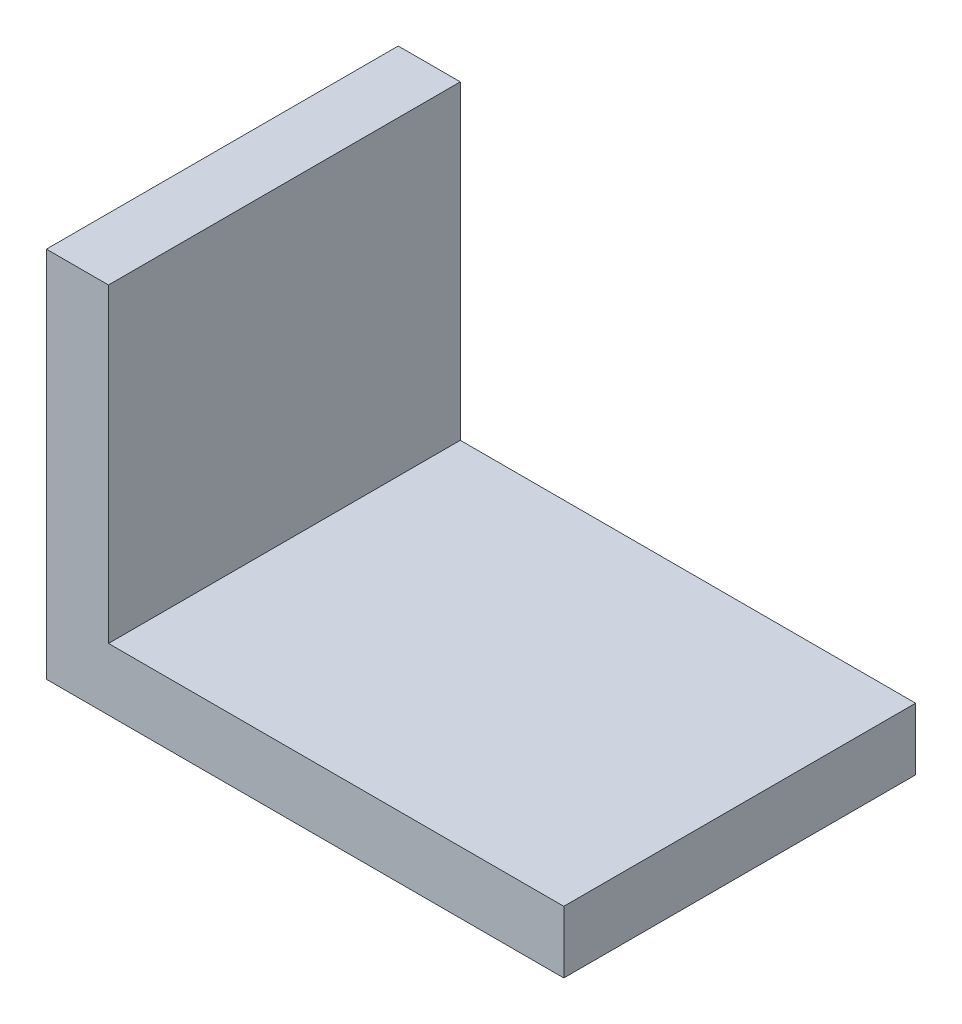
ISO-10303-21;
HEADER;
FILE_DESCRIPTION(('STEP AP214'),'2;1');
FILE_NAME('part.step','',(''),(''),'','','');
FILE_SCHEMA(('AUTOMOTIVE_DESIGN { 1 0 10303 214 1 1 1 1 }'));
ENDSEC;
DATA;
#1=APPLICATION_CONTEXT('core data for automotive mechanical design processes');
#2=APPLICATION_PROTOCOL_DEFINITION('international standard','automotive_design',2000,#1);
#3=PRODUCT_CONTEXT('',#1,'mechanical');
#4=PRODUCT('Part','Part','',(#3));
#5=PRODUCT_RELATED_PRODUCT_CATEGORY('part','',(#4));
#6=PRODUCT_DEFINITION_FORMATION('','',#4);
#7=PRODUCT_DEFINITION_CONTEXT('part definition',#1,'design');
#8=PRODUCT_DEFINITION('design','',#6,#7);
#9=PRODUCT_DEFINITION_SHAPE('','',#8);
#10=(LENGTH_UNIT() NAMED_UNIT(*) SI_UNIT(.MILLI.,.METRE.));
#11=(NAMED_UNIT(*) PLANE_ANGLE_UNIT() SI_UNIT($,.RADIAN.));
#12=(NAMED_UNIT(*) SI_UNIT($,.STERADIAN.) SOLID_ANGLE_UNIT());
#13=UNCERTAINTY_MEASURE_WITH_UNIT(LENGTH_MEASURE(1.E-05),#10,'distance_accuracy_value','');
#14=(GEOMETRIC_REPRESENTATION_CONTEXT(3) GLOBAL_UNCERTAINTY_ASSIGNED_CONTEXT((#13)) GLOBAL_UNIT_ASSIGNED_CONTEXT((#10,
#11,#12)) REPRESENTATION_CONTEXT('',''));
#15=CARTESIAN_POINT('',(0.,0.,0.));
#16=DIRECTION('',(0.,0.,1.));
#17=DIRECTION('',(1.,0.,0.));
#18=AXIS2_PLACEMENT_3D('',#15,#16,#17);
#19=CARTESIAN_POINT('',(125.,0.,42.5));
#20=DIRECTION('',(0.,1.,0.));
#21=DIRECTION('',(-1.,0.,0.));
#22=AXIS2_PLACEMENT_3D('',#19,#20,#21);
#23=PLANE('',#22);
#24=DIRECTION('',(1.,0.,0.));
#25=VECTOR('',#24,1.);
#26=CARTESIAN_POINT('',(125.,0.,-42.5));
#27=LINE('',#26,#25);
#28=CARTESIAN_POINT('',(0.,0.,-42.5));
#29=VERTEX_POINT('',#28);
#30=CARTESIAN_POINT('',(125.,0.,-42.5));
#31=VERTEX_POINT('',#30);
#32=EDGE_CURVE('E88',#29,#31,#27,.T.);
#33=ORIENTED_EDGE('',*,*,#32,.T.);
#34=DIRECTION('',(0.,0.,-1.));
#35=VECTOR('',#34,1.);
#36=CARTESIAN_POINT('',(125.,0.,42.5));
#37=LINE('',#36,#35);
#38=CARTESIAN_POINT('',(125.,0.,42.5));
#39=VERTEX_POINT('',#38);
#40=EDGE_CURVE('E11',#39,#31,#37,.T.);
#41=ORIENTED_EDGE('',*,*,#40,.F.);
#42=DIRECTION('',(1.,0.,0.));
#43=VECTOR('',#42,1.);
#44=CARTESIAN_POINT('',(125.,0.,42.5));
#45=LINE('',#44,#43);
#46=CARTESIAN_POINT('',(0.,0.,42.5));
#47=VERTEX_POINT('',#46);
#48=EDGE_CURVE('E111',#47,#39,#45,.T.);
#49=ORIENTED_EDGE('',*,*,#48,.F.);
#50=DIRECTION('',(0.,0.,-1.));
#51=VECTOR('',#50,1.);
#52=CARTESIAN_POINT('',(0.,0.,42.5));
#53=LINE('',#52,#51);
#54=EDGE_CURVE('E101',#47,#29,#53,.T.);
#55=ORIENTED_EDGE('',*,*,#54,.T.);
#56=EDGE_LOOP('',(#33,#41,#49,#55));
#57=FACE_BOUND('',#56,.T.);
#58=ADVANCED_FACE('F32',(#57),#23,.F.);
#59=CARTESIAN_POINT('',(125.,15.,42.5));
#60=DIRECTION('',(-1.,0.,0.));
#61=DIRECTION('',(0.,0.,1.));
#62=AXIS2_PLACEMENT_3D('',#59,#60,#61);
#63=PLANE('',#62);
#64=DIRECTION('',(0.,1.,0.));
#65=VECTOR('',#64,1.);
#66=CARTESIAN_POINT('',(125.,15.,-42.5));
#67=LINE('',#66,#65);
#68=CARTESIAN_POINT('',(125.,15.,-42.5));
#69=VERTEX_POINT('',#68);
#70=EDGE_CURVE('E84',#31,#69,#67,.T.);
#71=ORIENTED_EDGE('',*,*,#70,.T.);
#72=DIRECTION('',(0.,0.,-1.));
#73=VECTOR('',#72,1.);
#74=CARTESIAN_POINT('',(125.,15.,42.5));
#75=LINE('',#74,#73);
#76=CARTESIAN_POINT('',(125.,15.,42.5));
#77=VERTEX_POINT('',#76);
#78=EDGE_CURVE('E39',#77,#69,#75,.T.);
#79=ORIENTED_EDGE('',*,*,#78,.F.);
#80=DIRECTION('',(0.,1.,0.));
#81=VECTOR('',#80,1.);
#82=CARTESIAN_POINT('',(125.,15.,42.5));
#83=LINE('',#82,#81);
#84=EDGE_CURVE('E97',#39,#77,#83,.T.);
#85=ORIENTED_EDGE('',*,*,#84,.F.);
#86=ORIENTED_EDGE('',*,*,#40,.T.);
#87=EDGE_LOOP('',(#71,#79,#85,#86));
#88=FACE_BOUND('',#87,.T.);
#89=ADVANCED_FACE('F96',(#88),#63,.F.);
#90=CARTESIAN_POINT('',(15.,15.,42.5));
#91=DIRECTION('',(0.,-1.,0.));
#92=DIRECTION('',(0.,0.,-1.));
#93=AXIS2_PLACEMENT_3D('',#90,#91,#92);
#94=PLANE('',#93);
#95=DIRECTION('',(-1.,0.,0.));
#96=VECTOR('',#95,1.);
#97=CARTESIAN_POINT('',(15.,15.,-42.5));
#98=LINE('',#97,#96);
#99=CARTESIAN_POINT('',(15.,15.,-42.5));
#100=VERTEX_POINT('',#99);
#101=EDGE_CURVE('E90',#69,#100,#98,.T.);
#102=ORIENTED_EDGE('',*,*,#101,.T.);
#103=DIRECTION('',(0.,0.,-1.));
#104=VECTOR('',#103,1.);
#105=CARTESIAN_POINT('',(15.,15.,42.5));
#106=LINE('',#105,#104);
#107=CARTESIAN_POINT('',(15.,15.,42.5));
#108=VERTEX_POINT('',#107);
#109=EDGE_CURVE('E127',#108,#100,#106,.T.);
#110=ORIENTED_EDGE('',*,*,#109,.F.);
#111=DIRECTION('',(-1.,0.,0.));
#112=VECTOR('',#111,1.);
#113=CARTESIAN_POINT('',(15.,15.,42.5));
#114=LINE('',#113,#112);
#115=EDGE_CURVE('E114',#77,#108,#114,.T.);
#116=ORIENTED_EDGE('',*,*,#115,.F.);
#117=ORIENTED_EDGE('',*,*,#78,.T.);
#118=EDGE_LOOP('',(#102,#110,#116,#117));
#119=FACE_BOUND('',#118,.T.);
#120=ADVANCED_FACE('F131',(#119),#94,.F.);
#121=CARTESIAN_POINT('',(15.,90.,42.5));
#122=DIRECTION('',(-1.,0.,0.));
#123=DIRECTION('',(0.,-1.,0.));
#124=AXIS2_PLACEMENT_3D('',#121,#122,#123);
#125=PLANE('',#124);
#126=DIRECTION('',(0.,1.,0.));
#127=VECTOR('',#126,1.);
#128=CARTESIAN_POINT('',(15.,90.,-42.5));
#129=LINE('',#128,#127);
#130=CARTESIAN_POINT('',(15.,90.,-42.5));
#131=VERTEX_POINT('',#130);
#132=EDGE_CURVE('E105',#100,#131,#129,.T.);
#133=ORIENTED_EDGE('',*,*,#132,.T.);
#134=DIRECTION('',(0.,0.,-1.));
#135=VECTOR('',#134,1.);
#136=CARTESIAN_POINT('',(15.,90.,42.5));
#137=LINE('',#136,#135);
#138=CARTESIAN_POINT('',(15.,90.,42.5));
#139=VERTEX_POINT('',#138);
#140=EDGE_CURVE('E124',#139,#131,#137,.T.);
#141=ORIENTED_EDGE('',*,*,#140,.F.);
#142=DIRECTION('',(0.,1.,0.));
#143=VECTOR('',#142,1.);
#144=CARTESIAN_POINT('',(15.,90.,42.5));
#145=LINE('',#144,#143);
#146=EDGE_CURVE('E116',#108,#139,#145,.T.);
#147=ORIENTED_EDGE('',*,*,#146,.F.);
#148=ORIENTED_EDGE('',*,*,#109,.T.);
#149=EDGE_LOOP('',(#133,#141,#147,#148));
#150=FACE_BOUND('',#149,.T.);
#151=ADVANCED_FACE('F137',(#150),#125,.F.);
#152=CARTESIAN_POINT('',(0.,90.,42.5));
#153=DIRECTION('',(0.,-1.,0.));
#154=DIRECTION('',(0.,0.,-1.));
#155=AXIS2_PLACEMENT_3D('',#152,#153,#154);
#156=PLANE('',#155);
#157=DIRECTION('',(-1.,0.,0.));
#158=VECTOR('',#157,1.);
#159=CARTESIAN_POINT('',(0.,90.,-42.5));
#160=LINE('',#159,#158);
#161=CARTESIAN_POINT('',(0.,90.,-42.5));
#162=VERTEX_POINT('',#161);
#163=EDGE_CURVE('E107',#131,#162,#160,.T.);
#164=ORIENTED_EDGE('',*,*,#163,.T.);
#165=DIRECTION('',(0.,0.,-1.));
#166=VECTOR('',#165,1.);
#167=CARTESIAN_POINT('',(0.,90.,42.5));
#168=LINE('',#167,#166);
#169=CARTESIAN_POINT('',(0.,90.,42.5));
#170=VERTEX_POINT('',#169);
#171=EDGE_CURVE('E121',#170,#162,#168,.T.);
#172=ORIENTED_EDGE('',*,*,#171,.F.);
#173=DIRECTION('',(-1.,0.,0.));
#174=VECTOR('',#173,1.);
#175=CARTESIAN_POINT('',(0.,90.,42.5));
#176=LINE('',#175,#174);
#177=EDGE_CURVE('E51',#139,#170,#176,.T.);
#178=ORIENTED_EDGE('',*,*,#177,.F.);
#179=ORIENTED_EDGE('',*,*,#140,.T.);
#180=EDGE_LOOP('',(#164,#172,#178,#179));
#181=FACE_BOUND('',#180,.T.);
#182=ADVANCED_FACE('F140',(#181),#156,.F.);
#183=CARTESIAN_POINT('',(0.,0.,42.5));
#184=DIRECTION('',(1.,0.,0.));
#185=DIRECTION('',(0.,1.,0.));
#186=AXIS2_PLACEMENT_3D('',#183,#184,#185);
#187=PLANE('',#186);
#188=DIRECTION('',(0.,-1.,0.));
#189=VECTOR('',#188,1.);
#190=CARTESIAN_POINT('',(0.,0.,-42.5));
#191=LINE('',#190,#189);
#192=EDGE_CURVE('E109',#162,#29,#191,.T.);
#193=ORIENTED_EDGE('',*,*,#192,.T.);
#194=ORIENTED_EDGE('',*,*,#54,.F.);
#195=DIRECTION('',(0.,-1.,0.));
#196=VECTOR('',#195,1.);
#197=CARTESIAN_POINT('',(0.,0.,42.5));
#198=LINE('',#197,#196);
#199=EDGE_CURVE('E46',#170,#47,#198,.T.);
#200=ORIENTED_EDGE('',*,*,#199,.F.);
#201=ORIENTED_EDGE('',*,*,#171,.T.);
#202=EDGE_LOOP('',(#193,#194,#200,#201));
#203=FACE_BOUND('',#202,.T.);
#204=ADVANCED_FACE('F142',(#203),#187,.F.);
#205=CARTESIAN_POINT('',(125.,0.,42.5));
#206=DIRECTION('',(0.,0.,1.));
#207=DIRECTION('',(1.,0.,0.));
#208=AXIS2_PLACEMENT_3D('',#205,#206,#207);
#209=PLANE('',#208);
#210=ORIENTED_EDGE('',*,*,#48,.T.);
#211=ORIENTED_EDGE('',*,*,#84,.T.);
#212=ORIENTED_EDGE('',*,*,#115,.T.);
#213=ORIENTED_EDGE('',*,*,#146,.T.);
#214=ORIENTED_EDGE('',*,*,#177,.T.);
#215=ORIENTED_EDGE('',*,*,#199,.T.);
#216=EDGE_LOOP('',(#210,#211,#212,#213,#214,#215));
#217=FACE_BOUND('',#216,.T.);
#218=ADVANCED_FACE('F134',(#217),#209,.T.);
#219=CARTESIAN_POINT('',(125.,0.,-42.5));
#220=DIRECTION('',(0.,0.,1.));
#221=DIRECTION('',(1.,0.,0.));
#222=AXIS2_PLACEMENT_3D('',#219,#220,#221);
#223=PLANE('',#222);
#224=ORIENTED_EDGE('',*,*,#32,.F.);
#225=ORIENTED_EDGE('',*,*,#192,.F.);
#226=ORIENTED_EDGE('',*,*,#163,.F.);
#227=ORIENTED_EDGE('',*,*,#132,.F.);
#228=ORIENTED_EDGE('',*,*,#101,.F.);
#229=ORIENTED_EDGE('',*,*,#70,.F.);
#230=EDGE_LOOP('',(#224,#225,#226,#227,#228,#229));
#231=FACE_BOUND('',#230,.T.);
#232=ADVANCED_FACE('F85',(#231),#223,.F.);
#233=CLOSED_SHELL('',(#58,#89,#120,#151,#182,#204,#218,#232));
#234=MANIFOLD_SOLID_BREP('B2',#233);
#235=ADVANCED_BREP_SHAPE_REPRESENTATION('',(#18,#234),#14);
#236=SHAPE_DEFINITION_REPRESENTATION(#9,#235);
ENDSEC;
END-ISO-10303-21;
